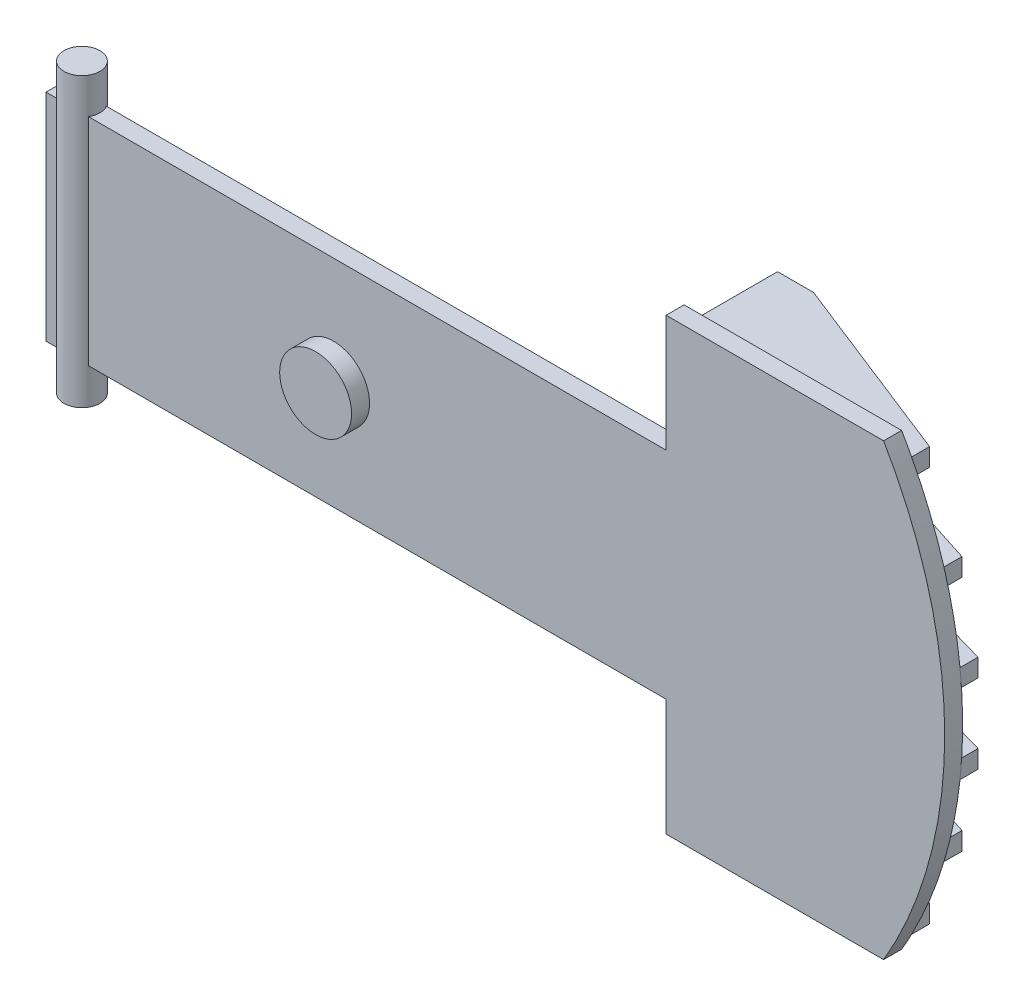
ISO-10303-21;
HEADER;
FILE_DESCRIPTION(('STEP AP214'),'2;1');
FILE_NAME('part.step','',(''),(''),'','','');
FILE_SCHEMA(('AUTOMOTIVE_DESIGN { 1 0 10303 214 1 1 1 1 }'));
ENDSEC;
DATA;
#1=APPLICATION_CONTEXT('core data for automotive mechanical design processes');
#2=APPLICATION_PROTOCOL_DEFINITION('international standard','automotive_design',2000,#1);
#3=PRODUCT_CONTEXT('',#1,'mechanical');
#4=PRODUCT('Part','Part','',(#3));
#5=PRODUCT_RELATED_PRODUCT_CATEGORY('part','',(#4));
#6=PRODUCT_DEFINITION_FORMATION('','',#4);
#7=PRODUCT_DEFINITION_CONTEXT('part definition',#1,'design');
#8=PRODUCT_DEFINITION('design','',#6,#7);
#9=PRODUCT_DEFINITION_SHAPE('','',#8);
#10=(LENGTH_UNIT() NAMED_UNIT(*) SI_UNIT(.MILLI.,.METRE.));
#11=(NAMED_UNIT(*) PLANE_ANGLE_UNIT() SI_UNIT($,.RADIAN.));
#12=(NAMED_UNIT(*) SI_UNIT($,.STERADIAN.) SOLID_ANGLE_UNIT());
#13=UNCERTAINTY_MEASURE_WITH_UNIT(LENGTH_MEASURE(1.E-05),#10,'distance_accuracy_value','');
#14=(GEOMETRIC_REPRESENTATION_CONTEXT(3) GLOBAL_UNCERTAINTY_ASSIGNED_CONTEXT((#13)) GLOBAL_UNIT_ASSIGNED_CONTEXT((#10,
#11,#12)) REPRESENTATION_CONTEXT('',''));
#15=CARTESIAN_POINT('',(0.,0.,0.));
#16=DIRECTION('',(0.,0.,1.));
#17=DIRECTION('',(1.,0.,0.));
#18=AXIS2_PLACEMENT_3D('',#15,#16,#17);
#19=CARTESIAN_POINT('',(25.3220588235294,0.,0.));
#20=DIRECTION('',(0.,0.,-1.));
#21=DIRECTION('',(-1.,0.,0.));
#22=AXIS2_PLACEMENT_3D('',#19,#20,#21);
#23=PLANE('',#22);
#24=DIRECTION('',(1.,0.,0.));
#25=VECTOR('',#24,1.);
#26=CARTESIAN_POINT('',(49.851852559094,-1.69999999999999,0.));
#27=LINE('',#26,#25);
#28=CARTESIAN_POINT('',(34.5,-1.69999999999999,0.));
#29=VERTEX_POINT('',#28);
#30=CARTESIAN_POINT('',(49.851852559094,-1.69999999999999,0.));
#31=VERTEX_POINT('',#30);
#32=EDGE_CURVE('E323',#29,#31,#27,.T.);
#33=ORIENTED_EDGE('',*,*,#32,.F.);
#34=DIRECTION('',(0.,-1.,0.));
#35=VECTOR('',#34,1.);
#36=CARTESIAN_POINT('',(34.5,-1.69999999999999,0.));
#37=LINE('',#36,#35);
#38=CARTESIAN_POINT('',(34.5,-2.69999999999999,0.));
#39=VERTEX_POINT('',#38);
#40=EDGE_CURVE('E308',#29,#39,#37,.T.);
#41=ORIENTED_EDGE('',*,*,#40,.T.);
#42=DIRECTION('',(1.,0.,0.));
#43=VECTOR('',#42,1.);
#44=CARTESIAN_POINT('',(49.851852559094,-2.69999999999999,0.));
#45=LINE('',#44,#43);
#46=CARTESIAN_POINT('',(49.851852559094,-2.70000000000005,0.));
#47=VERTEX_POINT('',#46);
#48=EDGE_CURVE('E314',#39,#47,#45,.T.);
#49=ORIENTED_EDGE('',*,*,#48,.T.);
#50=CARTESIAN_POINT('',(25.3220588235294,0.,0.));
#51=DIRECTION('',(0.,0.,1.));
#52=DIRECTION('',(-1.,0.,0.));
#53=AXIS2_PLACEMENT_3D('',#50,#51,#52);
#54=CIRCLE('',#53,24.6779411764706);
#55=CARTESIAN_POINT('',(48.9565840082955,-7.1,0.));
#56=VERTEX_POINT('',#55);
#57=EDGE_CURVE('E717',#56,#47,#54,.T.);
#58=ORIENTED_EDGE('',*,*,#57,.F.);
#59=DIRECTION('',(0.,-1.,0.));
#60=VECTOR('',#59,1.);
#61=CARTESIAN_POINT('',(48.9565840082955,-6.1,0.));
#62=LINE('',#61,#60);
#63=CARTESIAN_POINT('',(48.9565840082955,-6.1,0.));
#64=VERTEX_POINT('',#63);
#65=EDGE_CURVE('E354',#64,#56,#62,.T.);
#66=ORIENTED_EDGE('',*,*,#65,.F.);
#67=DIRECTION('',(1.,0.,0.));
#68=VECTOR('',#67,1.);
#69=CARTESIAN_POINT('',(48.9565840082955,-6.1,0.));
#70=LINE('',#69,#68);
#71=CARTESIAN_POINT('',(34.5,-6.1,0.));
#72=VERTEX_POINT('',#71);
#73=EDGE_CURVE('E346',#72,#64,#70,.T.);
#74=ORIENTED_EDGE('',*,*,#73,.F.);
#75=DIRECTION('',(0.,-1.,0.));
#76=VECTOR('',#75,1.);
#77=CARTESIAN_POINT('',(34.5,-6.,0.));
#78=LINE('',#77,#76);
#79=CARTESIAN_POINT('',(34.5,-6.,0.));
#80=VERTEX_POINT('',#79);
#81=EDGE_CURVE('E551',#80,#72,#78,.T.);
#82=ORIENTED_EDGE('',*,*,#81,.F.);
#83=DIRECTION('',(1.,0.,0.));
#84=VECTOR('',#83,1.);
#85=CARTESIAN_POINT('',(0.,-6.,0.));
#86=LINE('',#85,#84);
#87=CARTESIAN_POINT('',(2.36602540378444,-6.,0.));
#88=VERTEX_POINT('',#87);
#89=EDGE_CURVE('E546',#88,#80,#86,.T.);
#90=ORIENTED_EDGE('',*,*,#89,.F.);
#91=DIRECTION('',(0.,1.,0.));
#92=VECTOR('',#91,1.);
#93=CARTESIAN_POINT('',(2.36602540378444,-8.,0.));
#94=LINE('',#93,#92);
#95=CARTESIAN_POINT('',(2.36602540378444,6.,0.));
#96=VERTEX_POINT('',#95);
#97=EDGE_CURVE('E39',#88,#96,#94,.T.);
#98=ORIENTED_EDGE('',*,*,#97,.T.);
#99=DIRECTION('',(-1.,0.,0.));
#100=VECTOR('',#99,1.);
#101=CARTESIAN_POINT('',(0.,6.,0.));
#102=LINE('',#101,#100);
#103=CARTESIAN_POINT('',(34.5,6.,0.));
#104=VERTEX_POINT('',#103);
#105=EDGE_CURVE('E541',#104,#96,#102,.T.);
#106=ORIENTED_EDGE('',*,*,#105,.F.);
#107=DIRECTION('',(0.,-1.,0.));
#108=VECTOR('',#107,1.);
#109=CARTESIAN_POINT('',(34.5,6.,0.));
#110=LINE('',#109,#108);
#111=CARTESIAN_POINT('',(34.5,6.1,0.));
#112=VERTEX_POINT('',#111);
#113=EDGE_CURVE('E535',#112,#104,#110,.T.);
#114=ORIENTED_EDGE('',*,*,#113,.F.);
#115=DIRECTION('',(1.,0.,0.));
#116=VECTOR('',#115,1.);
#117=CARTESIAN_POINT('',(48.9565840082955,6.1,0.));
#118=LINE('',#117,#116);
#119=CARTESIAN_POINT('',(48.9565840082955,6.1,0.));
#120=VERTEX_POINT('',#119);
#121=EDGE_CURVE('E467',#112,#120,#118,.T.);
#122=ORIENTED_EDGE('',*,*,#121,.T.);
#123=DIRECTION('',(0.,1.,0.));
#124=VECTOR('',#123,1.);
#125=CARTESIAN_POINT('',(48.9565840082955,6.1,0.));
#126=LINE('',#125,#124);
#127=CARTESIAN_POINT('',(48.9565840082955,7.1,0.));
#128=VERTEX_POINT('',#127);
#129=EDGE_CURVE('E471',#120,#128,#126,.T.);
#130=ORIENTED_EDGE('',*,*,#129,.T.);
#131=CARTESIAN_POINT('',(49.851852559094,2.69999999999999,0.));
#132=VERTEX_POINT('',#131);
#133=EDGE_CURVE('E641',#132,#128,#54,.T.);
#134=ORIENTED_EDGE('',*,*,#133,.F.);
#135=DIRECTION('',(1.,0.,0.));
#136=VECTOR('',#135,1.);
#137=CARTESIAN_POINT('',(49.851852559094,2.69999999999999,0.));
#138=LINE('',#137,#136);
#139=CARTESIAN_POINT('',(34.5,2.69999999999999,0.));
#140=VERTEX_POINT('',#139);
#141=EDGE_CURVE('E412',#140,#132,#138,.T.);
#142=ORIENTED_EDGE('',*,*,#141,.F.);
#143=DIRECTION('',(0.,1.,0.));
#144=VECTOR('',#143,1.);
#145=CARTESIAN_POINT('',(34.5,1.69999999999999,0.));
#146=LINE('',#145,#144);
#147=CARTESIAN_POINT('',(34.5,1.69999999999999,0.));
#148=VERTEX_POINT('',#147);
#149=EDGE_CURVE('E434',#148,#140,#146,.T.);
#150=ORIENTED_EDGE('',*,*,#149,.F.);
#151=DIRECTION('',(1.,0.,0.));
#152=VECTOR('',#151,1.);
#153=CARTESIAN_POINT('',(49.851852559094,1.69999999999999,0.));
#154=LINE('',#153,#152);
#155=CARTESIAN_POINT('',(49.851852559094,1.69999999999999,0.));
#156=VERTEX_POINT('',#155);
#157=EDGE_CURVE('E426',#148,#156,#154,.T.);
#158=ORIENTED_EDGE('',*,*,#157,.T.);
#159=DIRECTION('',(0.,1.,0.));
#160=VECTOR('',#159,1.);
#161=CARTESIAN_POINT('',(49.851852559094,1.69999999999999,0.));
#162=LINE('',#161,#160);
#163=EDGE_CURVE('E430',#156,#132,#162,.T.);
#164=ORIENTED_EDGE('',*,*,#163,.T.);
#165=EDGE_CURVE('E563',#47,#132,#54,.T.);
#166=ORIENTED_EDGE('',*,*,#165,.F.);
#167=DIRECTION('',(0.,-1.,0.));
#168=VECTOR('',#167,1.);
#169=CARTESIAN_POINT('',(49.851852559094,-1.69999999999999,0.));
#170=LINE('',#169,#168);
#171=EDGE_CURVE('E324',#31,#47,#170,.T.);
#172=ORIENTED_EDGE('',*,*,#171,.F.);
#173=EDGE_LOOP('',(#33,#41,#49,#58,#66,#74,#82,#90,#98,#106,#114,#122,#130,#134,#142,#150,#158,
#164,#166,#172));
#174=FACE_BOUND('',#173,.T.);
#175=ADVANCED_FACE('F31',(#174),#23,.T.);
#176=CARTESIAN_POINT('',(34.5,-11.5,0.));
#177=VERTEX_POINT('',#176);
#178=CARTESIAN_POINT('',(34.5,-12.5,0.));
#179=VERTEX_POINT('',#178);
#180=EDGE_CURVE('E550',#177,#179,#78,.T.);
#181=ORIENTED_EDGE('',*,*,#180,.F.);
#182=DIRECTION('',(1.,0.,0.));
#183=VECTOR('',#182,1.);
#184=CARTESIAN_POINT('',(47.1566822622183,-11.5,0.));
#185=LINE('',#184,#183);
#186=CARTESIAN_POINT('',(47.1566822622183,-11.5,0.));
#187=VERTEX_POINT('',#186);
#188=EDGE_CURVE('E358',#177,#187,#185,.T.);
#189=ORIENTED_EDGE('',*,*,#188,.T.);
#190=CARTESIAN_POINT('',(46.6,-12.5,0.));
#191=VERTEX_POINT('',#190);
#192=EDGE_CURVE('E558',#191,#187,#54,.T.);
#193=ORIENTED_EDGE('',*,*,#192,.F.);
#194=DIRECTION('',(1.,0.,0.));
#195=VECTOR('',#194,1.);
#196=CARTESIAN_POINT('',(34.5,-12.5,0.));
#197=LINE('',#196,#195);
#198=EDGE_CURVE('E554',#179,#191,#197,.T.);
#199=ORIENTED_EDGE('',*,*,#198,.F.);
#200=EDGE_LOOP('',(#181,#189,#193,#199));
#201=FACE_BOUND('',#200,.T.);
#202=ADVANCED_FACE('F666',(#201),#23,.T.);
#203=DIRECTION('',(1.,0.,0.));
#204=VECTOR('',#203,1.);
#205=CARTESIAN_POINT('',(48.9565840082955,-7.1,0.));
#206=LINE('',#205,#204);
#207=CARTESIAN_POINT('',(34.5,-7.1,0.));
#208=VERTEX_POINT('',#207);
#209=EDGE_CURVE('E54',#208,#56,#206,.T.);
#210=ORIENTED_EDGE('',*,*,#209,.T.);
#211=EDGE_CURVE('E562',#187,#56,#54,.T.);
#212=ORIENTED_EDGE('',*,*,#211,.F.);
#213=DIRECTION('',(0.,-1.,0.));
#214=VECTOR('',#213,1.);
#215=CARTESIAN_POINT('',(47.1566822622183,-10.5,0.));
#216=LINE('',#215,#214);
#217=CARTESIAN_POINT('',(47.1566822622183,-10.5,0.));
#218=VERTEX_POINT('',#217);
#219=EDGE_CURVE('E390',#218,#187,#216,.T.);
#220=ORIENTED_EDGE('',*,*,#219,.F.);
#221=DIRECTION('',(1.,0.,0.));
#222=VECTOR('',#221,1.);
#223=CARTESIAN_POINT('',(47.1566822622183,-10.5,0.));
#224=LINE('',#223,#222);
#225=CARTESIAN_POINT('',(34.5,-10.5,0.));
#226=VERTEX_POINT('',#225);
#227=EDGE_CURVE('E377',#226,#218,#224,.T.);
#228=ORIENTED_EDGE('',*,*,#227,.F.);
#229=EDGE_CURVE('E555',#208,#226,#78,.T.);
#230=ORIENTED_EDGE('',*,*,#229,.F.);
#231=EDGE_LOOP('',(#210,#212,#220,#228,#230));
#232=FACE_BOUND('',#231,.T.);
#233=ADVANCED_FACE('F672',(#232),#23,.T.);
#234=CARTESIAN_POINT('',(47.1566822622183,11.5,0.));
#235=VERTEX_POINT('',#234);
#236=CARTESIAN_POINT('',(46.6,12.5,0.));
#237=VERTEX_POINT('',#236);
#238=EDGE_CURVE('E557',#235,#237,#54,.T.);
#239=ORIENTED_EDGE('',*,*,#238,.F.);
#240=DIRECTION('',(1.,0.,0.));
#241=VECTOR('',#240,1.);
#242=CARTESIAN_POINT('',(47.1566822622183,11.5,0.));
#243=LINE('',#242,#241);
#244=CARTESIAN_POINT('',(34.5,11.5,0.));
#245=VERTEX_POINT('',#244);
#246=EDGE_CURVE('E474',#245,#235,#243,.T.);
#247=ORIENTED_EDGE('',*,*,#246,.F.);
#248=CARTESIAN_POINT('',(34.5,12.5,0.));
#249=VERTEX_POINT('',#248);
#250=EDGE_CURVE('E536',#249,#245,#110,.T.);
#251=ORIENTED_EDGE('',*,*,#250,.F.);
#252=DIRECTION('',(-1.,0.,0.));
#253=VECTOR('',#252,1.);
#254=CARTESIAN_POINT('',(34.5,12.5,0.));
#255=LINE('',#254,#253);
#256=EDGE_CURVE('E561',#237,#249,#255,.T.);
#257=ORIENTED_EDGE('',*,*,#256,.F.);
#258=EDGE_LOOP('',(#239,#247,#251,#257));
#259=FACE_BOUND('',#258,.T.);
#260=ADVANCED_FACE('F693',(#259),#23,.T.);
#261=CARTESIAN_POINT('',(25.3220588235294,0.,1.));
#262=DIRECTION('',(0.,0.,-1.));
#263=DIRECTION('',(-1.,0.,0.));
#264=AXIS2_PLACEMENT_3D('',#261,#262,#263);
#265=PLANE('',#264);
#266=CARTESIAN_POINT('',(16.,0.,1.));
#267=DIRECTION('',(0.,0.,-1.));
#268=DIRECTION('',(-1.,0.,0.));
#269=AXIS2_PLACEMENT_3D('',#266,#267,#268);
#270=CIRCLE('',#269,2.);
#271=CARTESIAN_POINT('',(14.,0.,1.));
#272=VERTEX_POINT('',#271);
#273=EDGE_CURVE('E610',#272,#272,#270,.F.);
#274=ORIENTED_EDGE('',*,*,#273,.F.);
#275=EDGE_LOOP('',(#274));
#276=FACE_BOUND('',#275,.T.);
#277=DIRECTION('',(0.,1.,0.));
#278=VECTOR('',#277,1.);
#279=CARTESIAN_POINT('',(2.36602540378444,-8.,1.));
#280=LINE('',#279,#278);
#281=CARTESIAN_POINT('',(2.36602540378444,-6.,1.));
#282=VERTEX_POINT('',#281);
#283=CARTESIAN_POINT('',(2.36602540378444,6.,1.));
#284=VERTEX_POINT('',#283);
#285=EDGE_CURVE('E527',#282,#284,#280,.T.);
#286=ORIENTED_EDGE('',*,*,#285,.F.);
#287=DIRECTION('',(1.,0.,0.));
#288=VECTOR('',#287,1.);
#289=CARTESIAN_POINT('',(0.,-6.,1.));
#290=LINE('',#289,#288);
#291=CARTESIAN_POINT('',(34.5,-6.,1.));
#292=VERTEX_POINT('',#291);
#293=EDGE_CURVE('E574',#282,#292,#290,.T.);
#294=ORIENTED_EDGE('',*,*,#293,.T.);
#295=DIRECTION('',(0.,-1.,0.));
#296=VECTOR('',#295,1.);
#297=CARTESIAN_POINT('',(34.5,-6.,1.));
#298=LINE('',#297,#296);
#299=CARTESIAN_POINT('',(34.5,-12.5,1.));
#300=VERTEX_POINT('',#299);
#301=EDGE_CURVE('E578',#292,#300,#298,.T.);
#302=ORIENTED_EDGE('',*,*,#301,.T.);
#303=DIRECTION('',(1.,0.,0.));
#304=VECTOR('',#303,1.);
#305=CARTESIAN_POINT('',(34.5,-12.5,1.));
#306=LINE('',#305,#304);
#307=CARTESIAN_POINT('',(46.6,-12.5,1.));
#308=VERTEX_POINT('',#307);
#309=EDGE_CURVE('E580',#300,#308,#306,.T.);
#310=ORIENTED_EDGE('',*,*,#309,.T.);
#311=CARTESIAN_POINT('',(25.3220588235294,0.,1.));
#312=DIRECTION('',(0.,0.,1.));
#313=DIRECTION('',(-1.,0.,0.));
#314=AXIS2_PLACEMENT_3D('',#311,#312,#313);
#315=CIRCLE('',#314,24.6779411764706);
#316=CARTESIAN_POINT('',(46.6,12.5,1.));
#317=VERTEX_POINT('',#316);
#318=EDGE_CURVE('E582',#308,#317,#315,.T.);
#319=ORIENTED_EDGE('',*,*,#318,.T.);
#320=DIRECTION('',(-1.,0.,0.));
#321=VECTOR('',#320,1.);
#322=CARTESIAN_POINT('',(34.5,12.5,1.));
#323=LINE('',#322,#321);
#324=CARTESIAN_POINT('',(34.5,12.5,1.));
#325=VERTEX_POINT('',#324);
#326=EDGE_CURVE('E584',#317,#325,#323,.T.);
#327=ORIENTED_EDGE('',*,*,#326,.T.);
#328=DIRECTION('',(0.,-1.,0.));
#329=VECTOR('',#328,1.);
#330=CARTESIAN_POINT('',(34.5,6.,1.));
#331=LINE('',#330,#329);
#332=CARTESIAN_POINT('',(34.5,6.,1.));
#333=VERTEX_POINT('',#332);
#334=EDGE_CURVE('E565',#325,#333,#331,.T.);
#335=ORIENTED_EDGE('',*,*,#334,.T.);
#336=DIRECTION('',(-1.,0.,0.));
#337=VECTOR('',#336,1.);
#338=CARTESIAN_POINT('',(0.,6.,1.));
#339=LINE('',#338,#337);
#340=EDGE_CURVE('E569',#333,#284,#339,.T.);
#341=ORIENTED_EDGE('',*,*,#340,.T.);
#342=EDGE_LOOP('',(#286,#294,#302,#310,#319,#327,#335,#341));
#343=FACE_BOUND('',#342,.T.);
#344=ADVANCED_FACE('F701',(#276,#343),#265,.F.);
#345=CARTESIAN_POINT('',(0.,6.,1.));
#346=DIRECTION('',(0.,-1.,0.));
#347=DIRECTION('',(0.,0.,-1.));
#348=AXIS2_PLACEMENT_3D('',#345,#346,#347);
#349=PLANE('',#348);
#350=CARTESIAN_POINT('',(1.5,6.,0.5));
#351=DIRECTION('',(0.,-1.,0.));
#352=DIRECTION('',(0.,0.,-1.));
#353=AXIS2_PLACEMENT_3D('',#350,#351,#352);
#354=CIRCLE('',#353,1.);
#355=EDGE_CURVE('E524',#284,#96,#354,.F.);
#356=ORIENTED_EDGE('',*,*,#355,.F.);
#357=ORIENTED_EDGE('',*,*,#340,.F.);
#358=DIRECTION('',(0.,0.,-1.));
#359=VECTOR('',#358,1.);
#360=CARTESIAN_POINT('',(34.5,6.,1.));
#361=LINE('',#360,#359);
#362=EDGE_CURVE('E607',#333,#104,#361,.T.);
#363=ORIENTED_EDGE('',*,*,#362,.T.);
#364=ORIENTED_EDGE('',*,*,#105,.T.);
#365=EDGE_LOOP('',(#356,#357,#363,#364));
#366=FACE_BOUND('',#365,.T.);
#367=ADVANCED_FACE('F621',(#366),#349,.F.);
#368=CARTESIAN_POINT('',(0.,-6.,1.));
#369=DIRECTION('',(0.,1.,0.));
#370=DIRECTION('',(0.,0.,1.));
#371=AXIS2_PLACEMENT_3D('',#368,#369,#370);
#372=PLANE('',#371);
#373=CARTESIAN_POINT('',(1.5,-6.,0.5));
#374=DIRECTION('',(0.,1.,0.));
#375=DIRECTION('',(0.,0.,1.));
#376=AXIS2_PLACEMENT_3D('',#373,#374,#375);
#377=CIRCLE('',#376,1.);
#378=EDGE_CURVE('E522',#88,#282,#377,.F.);
#379=ORIENTED_EDGE('',*,*,#378,.F.);
#380=ORIENTED_EDGE('',*,*,#89,.T.);
#381=DIRECTION('',(0.,0.,-1.));
#382=VECTOR('',#381,1.);
#383=CARTESIAN_POINT('',(34.5,-6.,1.));
#384=LINE('',#383,#382);
#385=EDGE_CURVE('E598',#292,#80,#384,.T.);
#386=ORIENTED_EDGE('',*,*,#385,.F.);
#387=ORIENTED_EDGE('',*,*,#293,.F.);
#388=EDGE_LOOP('',(#379,#380,#386,#387));
#389=FACE_BOUND('',#388,.T.);
#390=ADVANCED_FACE('F687',(#389),#372,.F.);
#391=DIRECTION('',(1.,0.,0.));
#392=VECTOR('',#391,1.);
#393=CARTESIAN_POINT('',(48.9565840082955,7.1,0.));
#394=LINE('',#393,#392);
#395=CARTESIAN_POINT('',(34.5,7.1,0.));
#396=VERTEX_POINT('',#395);
#397=EDGE_CURVE('E452',#396,#128,#394,.T.);
#398=ORIENTED_EDGE('',*,*,#397,.F.);
#399=CARTESIAN_POINT('',(34.5,10.5,0.));
#400=VERTEX_POINT('',#399);
#401=EDGE_CURVE('E540',#400,#396,#110,.T.);
#402=ORIENTED_EDGE('',*,*,#401,.F.);
#403=DIRECTION('',(1.,0.,0.));
#404=VECTOR('',#403,1.);
#405=CARTESIAN_POINT('',(47.1566822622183,10.5,0.));
#406=LINE('',#405,#404);
#407=CARTESIAN_POINT('',(47.1566822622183,10.5,0.));
#408=VERTEX_POINT('',#407);
#409=EDGE_CURVE('E493',#400,#408,#406,.T.);
#410=ORIENTED_EDGE('',*,*,#409,.T.);
#411=DIRECTION('',(0.,1.,0.));
#412=VECTOR('',#411,1.);
#413=CARTESIAN_POINT('',(47.1566822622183,10.5,0.));
#414=LINE('',#413,#412);
#415=EDGE_CURVE('E507',#408,#235,#414,.T.);
#416=ORIENTED_EDGE('',*,*,#415,.T.);
#417=EDGE_CURVE('E635',#128,#235,#54,.T.);
#418=ORIENTED_EDGE('',*,*,#417,.F.);
#419=EDGE_LOOP('',(#398,#402,#410,#416,#418));
#420=FACE_BOUND('',#419,.T.);
#421=ADVANCED_FACE('F633',(#420),#23,.T.);
#422=CARTESIAN_POINT('',(34.5,6.,1.));
#423=DIRECTION('',(1.,0.,0.));
#424=DIRECTION('',(0.,0.,-1.));
#425=AXIS2_PLACEMENT_3D('',#422,#423,#424);
#426=PLANE('',#425);
#427=ORIENTED_EDGE('',*,*,#250,.T.);
#428=DIRECTION('',(0.,0.,1.));
#429=VECTOR('',#428,1.);
#430=CARTESIAN_POINT('',(34.5,11.5,0.));
#431=LINE('',#430,#429);
#432=CARTESIAN_POINT('',(34.5,11.5,-5.2));
#433=VERTEX_POINT('',#432);
#434=EDGE_CURVE('E491',#433,#245,#431,.T.);
#435=ORIENTED_EDGE('',*,*,#434,.F.);
#436=DIRECTION('',(0.,1.,0.));
#437=VECTOR('',#436,1.);
#438=CARTESIAN_POINT('',(34.5,10.5,-5.2));
#439=LINE('',#438,#437);
#440=CARTESIAN_POINT('',(34.5,10.5,-5.2));
#441=VERTEX_POINT('',#440);
#442=EDGE_CURVE('E508',#441,#433,#439,.T.);
#443=ORIENTED_EDGE('',*,*,#442,.F.);
#444=DIRECTION('',(0.,0.,1.));
#445=VECTOR('',#444,1.);
#446=CARTESIAN_POINT('',(34.5,10.5,0.));
#447=LINE('',#446,#445);
#448=EDGE_CURVE('E505',#441,#400,#447,.T.);
#449=ORIENTED_EDGE('',*,*,#448,.T.);
#450=ORIENTED_EDGE('',*,*,#401,.T.);
#451=DIRECTION('',(0.,0.,1.));
#452=VECTOR('',#451,1.);
#453=CARTESIAN_POINT('',(34.5,7.1,0.));
#454=LINE('',#453,#452);
#455=CARTESIAN_POINT('',(34.5,7.1,-5.));
#456=VERTEX_POINT('',#455);
#457=EDGE_CURVE('E450',#456,#396,#454,.T.);
#458=ORIENTED_EDGE('',*,*,#457,.F.);
#459=DIRECTION('',(0.,1.,0.));
#460=VECTOR('',#459,1.);
#461=CARTESIAN_POINT('',(34.5,6.1,-5.));
#462=LINE('',#461,#460);
#463=CARTESIAN_POINT('',(34.5,6.1,-5.));
#464=VERTEX_POINT('',#463);
#465=EDGE_CURVE('E475',#464,#456,#462,.T.);
#466=ORIENTED_EDGE('',*,*,#465,.F.);
#467=DIRECTION('',(0.,0.,1.));
#468=VECTOR('',#467,1.);
#469=CARTESIAN_POINT('',(34.5,6.1,0.));
#470=LINE('',#469,#468);
#471=EDGE_CURVE('E464',#464,#112,#470,.T.);
#472=ORIENTED_EDGE('',*,*,#471,.T.);
#473=ORIENTED_EDGE('',*,*,#113,.T.);
#474=ORIENTED_EDGE('',*,*,#362,.F.);
#475=ORIENTED_EDGE('',*,*,#334,.F.);
#476=DIRECTION('',(0.,0.,-1.));
#477=VECTOR('',#476,1.);
#478=CARTESIAN_POINT('',(34.5,12.5,1.));
#479=LINE('',#478,#477);
#480=EDGE_CURVE('E586',#325,#249,#479,.T.);
#481=ORIENTED_EDGE('',*,*,#480,.T.);
#482=EDGE_LOOP('',(#427,#435,#443,#449,#450,#458,#466,#472,#473,#474,#475,#481));
#483=FACE_BOUND('',#482,.T.);
#484=ADVANCED_FACE('F33',(#483),#426,.F.);
#485=CARTESIAN_POINT('',(34.5,-6.,1.));
#486=DIRECTION('',(1.,0.,0.));
#487=DIRECTION('',(0.,0.,-1.));
#488=AXIS2_PLACEMENT_3D('',#485,#486,#487);
#489=PLANE('',#488);
#490=ORIENTED_EDGE('',*,*,#81,.T.);
#491=DIRECTION('',(0.,0.,1.));
#492=VECTOR('',#491,1.);
#493=CARTESIAN_POINT('',(34.5,-6.1,0.));
#494=LINE('',#493,#492);
#495=CARTESIAN_POINT('',(34.5,-6.1,-5.));
#496=VERTEX_POINT('',#495);
#497=EDGE_CURVE('E348',#496,#72,#494,.T.);
#498=ORIENTED_EDGE('',*,*,#497,.F.);
#499=DIRECTION('',(0.,-1.,0.));
#500=VECTOR('',#499,1.);
#501=CARTESIAN_POINT('',(34.5,-6.1,-5.));
#502=LINE('',#501,#500);
#503=CARTESIAN_POINT('',(34.5,-7.1,-5.));
#504=VERTEX_POINT('',#503);
#505=EDGE_CURVE('E362',#496,#504,#502,.T.);
#506=ORIENTED_EDGE('',*,*,#505,.T.);
#507=DIRECTION('',(0.,0.,1.));
#508=VECTOR('',#507,1.);
#509=CARTESIAN_POINT('',(34.5,-7.1,0.));
#510=LINE('',#509,#508);
#511=EDGE_CURVE('E337',#504,#208,#510,.T.);
#512=ORIENTED_EDGE('',*,*,#511,.T.);
#513=ORIENTED_EDGE('',*,*,#229,.T.);
#514=DIRECTION('',(0.,0.,1.));
#515=VECTOR('',#514,1.);
#516=CARTESIAN_POINT('',(34.5,-10.5,0.));
#517=LINE('',#516,#515);
#518=CARTESIAN_POINT('',(34.5,-10.5,-5.2));
#519=VERTEX_POINT('',#518);
#520=EDGE_CURVE('E380',#519,#226,#517,.T.);
#521=ORIENTED_EDGE('',*,*,#520,.F.);
#522=DIRECTION('',(0.,-1.,0.));
#523=VECTOR('',#522,1.);
#524=CARTESIAN_POINT('',(34.5,-10.5,-5.2));
#525=LINE('',#524,#523);
#526=CARTESIAN_POINT('',(34.5,-11.5,-5.2));
#527=VERTEX_POINT('',#526);
#528=EDGE_CURVE('E389',#519,#527,#525,.T.);
#529=ORIENTED_EDGE('',*,*,#528,.T.);
#530=DIRECTION('',(0.,0.,1.));
#531=VECTOR('',#530,1.);
#532=CARTESIAN_POINT('',(34.5,-11.5,0.));
#533=LINE('',#532,#531);
#534=EDGE_CURVE('E368',#527,#177,#533,.T.);
#535=ORIENTED_EDGE('',*,*,#534,.T.);
#536=ORIENTED_EDGE('',*,*,#180,.T.);
#537=DIRECTION('',(0.,0.,-1.));
#538=VECTOR('',#537,1.);
#539=CARTESIAN_POINT('',(34.5,-12.5,1.));
#540=LINE('',#539,#538);
#541=EDGE_CURVE('E595',#300,#179,#540,.T.);
#542=ORIENTED_EDGE('',*,*,#541,.F.);
#543=ORIENTED_EDGE('',*,*,#301,.F.);
#544=ORIENTED_EDGE('',*,*,#385,.T.);
#545=EDGE_LOOP('',(#490,#498,#506,#512,#513,#521,#529,#535,#536,#542,#543,#544));
#546=FACE_BOUND('',#545,.T.);
#547=ADVANCED_FACE('F698',(#546),#489,.F.);
#548=CARTESIAN_POINT('',(34.5,-12.5,1.));
#549=DIRECTION('',(0.,1.,0.));
#550=DIRECTION('',(0.,0.,1.));
#551=AXIS2_PLACEMENT_3D('',#548,#549,#550);
#552=PLANE('',#551);
#553=ORIENTED_EDGE('',*,*,#198,.T.);
#554=DIRECTION('',(0.,0.,-1.));
#555=VECTOR('',#554,1.);
#556=CARTESIAN_POINT('',(46.6,-12.5,1.));
#557=LINE('',#556,#555);
#558=EDGE_CURVE('E592',#308,#191,#557,.T.);
#559=ORIENTED_EDGE('',*,*,#558,.F.);
#560=ORIENTED_EDGE('',*,*,#309,.F.);
#561=ORIENTED_EDGE('',*,*,#541,.T.);
#562=EDGE_LOOP('',(#553,#559,#560,#561));
#563=FACE_BOUND('',#562,.T.);
#564=ADVANCED_FACE('F743',(#563),#552,.F.);
#565=CARTESIAN_POINT('',(25.3220588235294,0.,1.));
#566=DIRECTION('',(0.,0.,-1.));
#567=DIRECTION('',(-1.,0.,0.));
#568=AXIS2_PLACEMENT_3D('',#565,#566,#567);
#569=CYLINDRICAL_SURFACE('',#568,24.6779411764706);
#570=ORIENTED_EDGE('',*,*,#192,.T.);
#571=ORIENTED_EDGE('',*,*,#211,.T.);
#572=ORIENTED_EDGE('',*,*,#57,.T.);
#573=ORIENTED_EDGE('',*,*,#165,.T.);
#574=ORIENTED_EDGE('',*,*,#133,.T.);
#575=ORIENTED_EDGE('',*,*,#417,.T.);
#576=ORIENTED_EDGE('',*,*,#238,.T.);
#577=DIRECTION('',(0.,0.,-1.));
#578=VECTOR('',#577,1.);
#579=CARTESIAN_POINT('',(46.6,12.5,1.));
#580=LINE('',#579,#578);
#581=EDGE_CURVE('E589',#317,#237,#580,.T.);
#582=ORIENTED_EDGE('',*,*,#581,.F.);
#583=ORIENTED_EDGE('',*,*,#318,.F.);
#584=ORIENTED_EDGE('',*,*,#558,.T.);
#585=EDGE_LOOP('',(#570,#571,#572,#573,#574,#575,#576,#582,#583,#584));
#586=FACE_BOUND('',#585,.T.);
#587=ADVANCED_FACE('F721',(#586),#569,.T.);
#588=CARTESIAN_POINT('',(34.5,12.5,1.));
#589=DIRECTION('',(0.,-1.,0.));
#590=DIRECTION('',(0.,0.,-1.));
#591=AXIS2_PLACEMENT_3D('',#588,#589,#590);
#592=PLANE('',#591);
#593=ORIENTED_EDGE('',*,*,#256,.T.);
#594=ORIENTED_EDGE('',*,*,#480,.F.);
#595=ORIENTED_EDGE('',*,*,#326,.F.);
#596=ORIENTED_EDGE('',*,*,#581,.T.);
#597=EDGE_LOOP('',(#593,#594,#595,#596));
#598=FACE_BOUND('',#597,.T.);
#599=ADVANCED_FACE('F1030',(#598),#592,.F.);
#600=CARTESIAN_POINT('',(16.,0.,2.));
#601=DIRECTION('',(0.,0.,-1.));
#602=DIRECTION('',(-1.,0.,0.));
#603=AXIS2_PLACEMENT_3D('',#600,#601,#602);
#604=CYLINDRICAL_SURFACE('',#603,2.);
#605=CARTESIAN_POINT('',(16.,0.,2.));
#606=DIRECTION('',(0.,0.,1.));
#607=DIRECTION('',(1.,0.,0.));
#608=AXIS2_PLACEMENT_3D('',#605,#606,#607);
#609=CIRCLE('',#608,2.);
#610=CARTESIAN_POINT('',(18.,0.,2.));
#611=VERTEX_POINT('',#610);
#612=EDGE_CURVE('E532',#611,#611,#609,.T.);
#613=ORIENTED_EDGE('',*,*,#612,.F.);
#614=EDGE_LOOP('',(#613));
#615=FACE_BOUND('',#614,.T.);
#616=ORIENTED_EDGE('',*,*,#273,.T.);
#617=EDGE_LOOP('',(#616));
#618=FACE_BOUND('',#617,.T.);
#619=ADVANCED_FACE('F1244',(#615,#618),#604,.T.);
#620=CARTESIAN_POINT('',(16.,0.,2.));
#621=DIRECTION('',(0.,0.,1.));
#622=DIRECTION('',(1.,0.,0.));
#623=AXIS2_PLACEMENT_3D('',#620,#621,#622);
#624=PLANE('',#623);
#625=ORIENTED_EDGE('',*,*,#612,.T.);
#626=EDGE_LOOP('',(#625));
#627=FACE_BOUND('',#626,.T.);
#628=ADVANCED_FACE('F758',(#627),#624,.T.);
#629=CARTESIAN_POINT('',(1.5,-8.,0.5));
#630=DIRECTION('',(0.,1.,0.));
#631=DIRECTION('',(0.,0.,1.));
#632=AXIS2_PLACEMENT_3D('',#629,#630,#631);
#633=CYLINDRICAL_SURFACE('',#632,1.);
#634=ORIENTED_EDGE('',*,*,#378,.T.);
#635=ORIENTED_EDGE('',*,*,#285,.T.);
#636=ORIENTED_EDGE('',*,*,#355,.T.);
#637=ORIENTED_EDGE('',*,*,#97,.F.);
#638=EDGE_LOOP('',(#634,#635,#636,#637));
#639=FACE_BOUND('',#638,.T.);
#640=CARTESIAN_POINT('',(1.5,-8.,0.5));
#641=DIRECTION('',(0.,-1.,0.));
#642=DIRECTION('',(0.,0.,-1.));
#643=AXIS2_PLACEMENT_3D('',#640,#641,#642);
#644=CIRCLE('',#643,1.);
#645=CARTESIAN_POINT('',(1.5,-8.,-0.5));
#646=VERTEX_POINT('',#645);
#647=EDGE_CURVE('E519',#646,#646,#644,.T.);
#648=ORIENTED_EDGE('',*,*,#647,.F.);
#649=EDGE_LOOP('',(#648));
#650=FACE_BOUND('',#649,.T.);
#651=CARTESIAN_POINT('',(1.5,8.,0.5));
#652=DIRECTION('',(0.,-1.,0.));
#653=DIRECTION('',(0.,0.,-1.));
#654=AXIS2_PLACEMENT_3D('',#651,#652,#653);
#655=CIRCLE('',#654,1.);
#656=CARTESIAN_POINT('',(1.5,8.,-0.5));
#657=VERTEX_POINT('',#656);
#658=EDGE_CURVE('E510',#657,#657,#655,.T.);
#659=ORIENTED_EDGE('',*,*,#658,.T.);
#660=EDGE_LOOP('',(#659));
#661=FACE_BOUND('',#660,.T.);
#662=CARTESIAN_POINT('',(0.633974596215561,6.,0.));
#663=VERTEX_POINT('',#662);
#664=CARTESIAN_POINT('',(0.633974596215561,6.,1.));
#665=VERTEX_POINT('',#664);
#666=EDGE_CURVE('E528',#663,#665,#354,.F.);
#667=ORIENTED_EDGE('',*,*,#666,.T.);
#668=DIRECTION('',(0.,1.,0.));
#669=VECTOR('',#668,1.);
#670=CARTESIAN_POINT('',(0.633974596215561,-8.,1.));
#671=LINE('',#670,#669);
#672=CARTESIAN_POINT('',(0.633974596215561,-6.,1.));
#673=VERTEX_POINT('',#672);
#674=EDGE_CURVE('E530',#665,#673,#671,.F.);
#675=ORIENTED_EDGE('',*,*,#674,.T.);
#676=CARTESIAN_POINT('',(0.633974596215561,-6.,0.));
#677=VERTEX_POINT('',#676);
#678=EDGE_CURVE('E525',#673,#677,#377,.F.);
#679=ORIENTED_EDGE('',*,*,#678,.T.);
#680=DIRECTION('',(0.,1.,0.));
#681=VECTOR('',#680,1.);
#682=CARTESIAN_POINT('',(0.633974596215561,-8.,0.));
#683=LINE('',#682,#681);
#684=EDGE_CURVE('E11',#663,#677,#683,.F.);
#685=ORIENTED_EDGE('',*,*,#684,.F.);
#686=EDGE_LOOP('',(#667,#675,#679,#685));
#687=FACE_BOUND('',#686,.T.);
#688=ADVANCED_FACE('F754',(#639,#650,#661,#687),#633,.T.);
#689=CARTESIAN_POINT('',(1.5,-8.,0.5));
#690=DIRECTION('',(0.,-1.,0.));
#691=DIRECTION('',(0.,0.,-1.));
#692=AXIS2_PLACEMENT_3D('',#689,#690,#691);
#693=PLANE('',#692);
#694=ORIENTED_EDGE('',*,*,#647,.T.);
#695=EDGE_LOOP('',(#694));
#696=FACE_BOUND('',#695,.T.);
#697=ADVANCED_FACE('F757',(#696),#693,.T.);
#698=CARTESIAN_POINT('',(1.5,8.,0.5));
#699=DIRECTION('',(0.,-1.,0.));
#700=DIRECTION('',(0.,0.,-1.));
#701=AXIS2_PLACEMENT_3D('',#698,#699,#700);
#702=PLANE('',#701);
#703=ORIENTED_EDGE('',*,*,#658,.F.);
#704=EDGE_LOOP('',(#703));
#705=FACE_BOUND('',#704,.T.);
#706=ADVANCED_FACE('F688',(#705),#702,.F.);
#707=CARTESIAN_POINT('',(0.,-6.,1.));
#708=DIRECTION('',(1.,0.,0.));
#709=DIRECTION('',(0.,0.,-1.));
#710=AXIS2_PLACEMENT_3D('',#707,#708,#709);
#711=PLANE('',#710);
#712=DIRECTION('',(0.,-1.,0.));
#713=VECTOR('',#712,1.);
#714=CARTESIAN_POINT('',(0.,-6.,0.));
#715=LINE('',#714,#713);
#716=CARTESIAN_POINT('',(0.,6.,0.));
#717=VERTEX_POINT('',#716);
#718=CARTESIAN_POINT('',(0.,-6.,0.));
#719=VERTEX_POINT('',#718);
#720=EDGE_CURVE('E544',#717,#719,#715,.T.);
#721=ORIENTED_EDGE('',*,*,#720,.T.);
#722=DIRECTION('',(0.,0.,-1.));
#723=VECTOR('',#722,1.);
#724=CARTESIAN_POINT('',(0.,-6.,1.));
#725=LINE('',#724,#723);
#726=CARTESIAN_POINT('',(0.,-6.,1.));
#727=VERTEX_POINT('',#726);
#728=EDGE_CURVE('E601',#727,#719,#725,.T.);
#729=ORIENTED_EDGE('',*,*,#728,.F.);
#730=DIRECTION('',(0.,-1.,0.));
#731=VECTOR('',#730,1.);
#732=CARTESIAN_POINT('',(0.,-6.,1.));
#733=LINE('',#732,#731);
#734=CARTESIAN_POINT('',(0.,6.,1.));
#735=VERTEX_POINT('',#734);
#736=EDGE_CURVE('E572',#735,#727,#733,.T.);
#737=ORIENTED_EDGE('',*,*,#736,.F.);
#738=DIRECTION('',(0.,0.,-1.));
#739=VECTOR('',#738,1.);
#740=CARTESIAN_POINT('',(0.,6.,1.));
#741=LINE('',#740,#739);
#742=EDGE_CURVE('E604',#735,#717,#741,.T.);
#743=ORIENTED_EDGE('',*,*,#742,.T.);
#744=EDGE_LOOP('',(#721,#729,#737,#743));
#745=FACE_BOUND('',#744,.T.);
#746=ADVANCED_FACE('F678',(#745),#711,.F.);
#747=EDGE_CURVE('E539',#663,#717,#102,.T.);
#748=ORIENTED_EDGE('',*,*,#747,.F.);
#749=ORIENTED_EDGE('',*,*,#684,.T.);
#750=EDGE_CURVE('E547',#719,#677,#86,.T.);
#751=ORIENTED_EDGE('',*,*,#750,.F.);
#752=ORIENTED_EDGE('',*,*,#720,.F.);
#753=EDGE_LOOP('',(#748,#749,#751,#752));
#754=FACE_BOUND('',#753,.T.);
#755=ADVANCED_FACE('F668',(#754),#23,.T.);
#756=ORIENTED_EDGE('',*,*,#678,.F.);
#757=EDGE_CURVE('E575',#727,#673,#290,.T.);
#758=ORIENTED_EDGE('',*,*,#757,.F.);
#759=ORIENTED_EDGE('',*,*,#728,.T.);
#760=ORIENTED_EDGE('',*,*,#750,.T.);
#761=EDGE_LOOP('',(#756,#758,#759,#760));
#762=FACE_BOUND('',#761,.T.);
#763=ADVANCED_FACE('F677',(#762),#372,.F.);
#764=ORIENTED_EDGE('',*,*,#666,.F.);
#765=ORIENTED_EDGE('',*,*,#747,.T.);
#766=ORIENTED_EDGE('',*,*,#742,.F.);
#767=EDGE_CURVE('E568',#665,#735,#339,.T.);
#768=ORIENTED_EDGE('',*,*,#767,.F.);
#769=EDGE_LOOP('',(#764,#765,#766,#768));
#770=FACE_BOUND('',#769,.T.);
#771=ADVANCED_FACE('F684',(#770),#349,.F.);
#772=ORIENTED_EDGE('',*,*,#674,.F.);
#773=ORIENTED_EDGE('',*,*,#767,.T.);
#774=ORIENTED_EDGE('',*,*,#736,.T.);
#775=ORIENTED_EDGE('',*,*,#757,.T.);
#776=EDGE_LOOP('',(#772,#773,#774,#775));
#777=FACE_BOUND('',#776,.T.);
#778=ADVANCED_FACE('F708',(#777),#265,.F.);
#779=CARTESIAN_POINT('',(34.5,10.5,-5.2));
#780=DIRECTION('',(0.,0.,-1.));
#781=DIRECTION('',(-1.,0.,0.));
#782=AXIS2_PLACEMENT_3D('',#779,#780,#781);
#783=PLANE('',#782);
#784=DIRECTION('',(-1.,0.,0.));
#785=VECTOR('',#784,1.);
#786=CARTESIAN_POINT('',(34.5,11.5,-5.2));
#787=LINE('',#786,#785);
#788=CARTESIAN_POINT('',(36.5,11.5,-5.2));
#789=VERTEX_POINT('',#788);
#790=EDGE_CURVE('E488',#789,#433,#787,.T.);
#791=ORIENTED_EDGE('',*,*,#790,.F.);
#792=DIRECTION('',(0.,1.,0.));
#793=VECTOR('',#792,1.);
#794=CARTESIAN_POINT('',(36.5,10.5,-5.2));
#795=LINE('',#794,#793);
#796=CARTESIAN_POINT('',(36.5,10.5,-5.2));
#797=VERTEX_POINT('',#796);
#798=EDGE_CURVE('E511',#797,#789,#795,.T.);
#799=ORIENTED_EDGE('',*,*,#798,.F.);
#800=DIRECTION('',(-1.,0.,0.));
#801=VECTOR('',#800,1.);
#802=CARTESIAN_POINT('',(34.5,10.5,-5.2));
#803=LINE('',#802,#801);
#804=EDGE_CURVE('E502',#797,#441,#803,.T.);
#805=ORIENTED_EDGE('',*,*,#804,.T.);
#806=ORIENTED_EDGE('',*,*,#442,.T.);
#807=EDGE_LOOP('',(#791,#799,#805,#806));
#808=FACE_BOUND('',#807,.T.);
#809=ADVANCED_FACE('F780',(#808),#783,.T.);
#810=CARTESIAN_POINT('',(47.1566822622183,10.5,-1.));
#811=DIRECTION('',(0.366669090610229,0.,-0.930351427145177));
#812=DIRECTION('',(-0.930351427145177,0.,-0.366669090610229));
#813=AXIS2_PLACEMENT_3D('',#810,#811,#812);
#814=PLANE('',#813);
#815=DIRECTION('',(-0.930351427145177,0.,-0.366669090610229));
#816=VECTOR('',#815,1.);
#817=CARTESIAN_POINT('',(47.1566822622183,11.5,-1.));
#818=LINE('',#817,#816);
#819=CARTESIAN_POINT('',(47.1566822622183,11.5,-1.));
#820=VERTEX_POINT('',#819);
#821=EDGE_CURVE('E485',#820,#789,#818,.T.);
#822=ORIENTED_EDGE('',*,*,#821,.F.);
#823=DIRECTION('',(0.,1.,0.));
#824=VECTOR('',#823,1.);
#825=CARTESIAN_POINT('',(47.1566822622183,10.5,-1.));
#826=LINE('',#825,#824);
#827=CARTESIAN_POINT('',(47.1566822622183,10.5,-1.));
#828=VERTEX_POINT('',#827);
#829=EDGE_CURVE('E513',#828,#820,#826,.T.);
#830=ORIENTED_EDGE('',*,*,#829,.F.);
#831=DIRECTION('',(-0.930351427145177,0.,-0.366669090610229));
#832=VECTOR('',#831,1.);
#833=CARTESIAN_POINT('',(47.1566822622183,10.5,-1.));
#834=LINE('',#833,#832);
#835=EDGE_CURVE('E499',#828,#797,#834,.T.);
#836=ORIENTED_EDGE('',*,*,#835,.T.);
#837=ORIENTED_EDGE('',*,*,#798,.T.);
#838=EDGE_LOOP('',(#822,#830,#836,#837));
#839=FACE_BOUND('',#838,.T.);
#840=ADVANCED_FACE('F851',(#839),#814,.T.);
#841=CARTESIAN_POINT('',(47.1566822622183,10.5,0.));
#842=DIRECTION('',(1.,0.,0.));
#843=DIRECTION('',(0.,0.,-1.));
#844=AXIS2_PLACEMENT_3D('',#841,#842,#843);
#845=PLANE('',#844);
#846=DIRECTION('',(0.,0.,-1.));
#847=VECTOR('',#846,1.);
#848=CARTESIAN_POINT('',(47.1566822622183,11.5,0.));
#849=LINE('',#848,#847);
#850=EDGE_CURVE('E482',#235,#820,#849,.T.);
#851=ORIENTED_EDGE('',*,*,#850,.F.);
#852=ORIENTED_EDGE('',*,*,#415,.F.);
#853=DIRECTION('',(0.,0.,-1.));
#854=VECTOR('',#853,1.);
#855=CARTESIAN_POINT('',(47.1566822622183,10.5,0.));
#856=LINE('',#855,#854);
#857=EDGE_CURVE('E496',#408,#828,#856,.T.);
#858=ORIENTED_EDGE('',*,*,#857,.T.);
#859=ORIENTED_EDGE('',*,*,#829,.T.);
#860=EDGE_LOOP('',(#851,#852,#858,#859));
#861=FACE_BOUND('',#860,.T.);
#862=ADVANCED_FACE('F861',(#861),#845,.T.);
#863=CARTESIAN_POINT('',(34.5,10.5,0.));
#864=DIRECTION('',(0.,-1.,0.));
#865=DIRECTION('',(0.,0.,-1.));
#866=AXIS2_PLACEMENT_3D('',#863,#864,#865);
#867=PLANE('',#866);
#868=ORIENTED_EDGE('',*,*,#409,.F.);
#869=ORIENTED_EDGE('',*,*,#448,.F.);
#870=ORIENTED_EDGE('',*,*,#804,.F.);
#871=ORIENTED_EDGE('',*,*,#835,.F.);
#872=ORIENTED_EDGE('',*,*,#857,.F.);
#873=EDGE_LOOP('',(#868,#869,#870,#871,#872));
#874=FACE_BOUND('',#873,.T.);
#875=ADVANCED_FACE('F871',(#874),#867,.T.);
#876=CARTESIAN_POINT('',(34.5,11.5,0.));
#877=DIRECTION('',(0.,-1.,0.));
#878=DIRECTION('',(0.,0.,-1.));
#879=AXIS2_PLACEMENT_3D('',#876,#877,#878);
#880=PLANE('',#879);
#881=ORIENTED_EDGE('',*,*,#246,.T.);
#882=ORIENTED_EDGE('',*,*,#850,.T.);
#883=ORIENTED_EDGE('',*,*,#821,.T.);
#884=ORIENTED_EDGE('',*,*,#790,.T.);
#885=ORIENTED_EDGE('',*,*,#434,.T.);
#886=EDGE_LOOP('',(#881,#882,#883,#884,#885));
#887=FACE_BOUND('',#886,.T.);
#888=ADVANCED_FACE('F662',(#887),#880,.F.);
#889=CARTESIAN_POINT('',(48.9565840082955,6.1,0.));
#890=DIRECTION('',(1.,0.,0.));
#891=DIRECTION('',(0.,0.,-1.));
#892=AXIS2_PLACEMENT_3D('',#889,#890,#891);
#893=PLANE('',#892);
#894=DIRECTION('',(0.,0.,-1.));
#895=VECTOR('',#894,1.);
#896=CARTESIAN_POINT('',(48.9565840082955,7.1,0.));
#897=LINE('',#896,#895);
#898=CARTESIAN_POINT('',(48.9565840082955,7.1,-1.));
#899=VERTEX_POINT('',#898);
#900=EDGE_CURVE('E433',#128,#899,#897,.T.);
#901=ORIENTED_EDGE('',*,*,#900,.F.);
#902=ORIENTED_EDGE('',*,*,#129,.F.);
#903=DIRECTION('',(0.,0.,-1.));
#904=VECTOR('',#903,1.);
#905=CARTESIAN_POINT('',(48.9565840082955,6.1,0.));
#906=LINE('',#905,#904);
#907=CARTESIAN_POINT('',(48.9565840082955,6.1,-1.));
#908=VERTEX_POINT('',#907);
#909=EDGE_CURVE('E455',#120,#908,#906,.T.);
#910=ORIENTED_EDGE('',*,*,#909,.T.);
#911=DIRECTION('',(0.,1.,0.));
#912=VECTOR('',#911,1.);
#913=CARTESIAN_POINT('',(48.9565840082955,6.1,-1.));
#914=LINE('',#913,#912);
#915=EDGE_CURVE('E470',#908,#899,#914,.T.);
#916=ORIENTED_EDGE('',*,*,#915,.T.);
#917=EDGE_LOOP('',(#901,#902,#910,#916));
#918=FACE_BOUND('',#917,.T.);
#919=ADVANCED_FACE('F644',(#918),#893,.T.);
#920=CARTESIAN_POINT('',(34.5,6.1,-5.));
#921=DIRECTION('',(0.,0.,-1.));
#922=DIRECTION('',(-1.,0.,0.));
#923=AXIS2_PLACEMENT_3D('',#920,#921,#922);
#924=PLANE('',#923);
#925=DIRECTION('',(-1.,0.,0.));
#926=VECTOR('',#925,1.);
#927=CARTESIAN_POINT('',(34.5,7.1,-5.));
#928=LINE('',#927,#926);
#929=CARTESIAN_POINT('',(36.5,7.1,-5.));
#930=VERTEX_POINT('',#929);
#931=EDGE_CURVE('E447',#930,#456,#928,.T.);
#932=ORIENTED_EDGE('',*,*,#931,.F.);
#933=DIRECTION('',(0.,1.,0.));
#934=VECTOR('',#933,1.);
#935=CARTESIAN_POINT('',(36.5,6.1,-5.));
#936=LINE('',#935,#934);
#937=CARTESIAN_POINT('',(36.5,6.1,-5.));
#938=VERTEX_POINT('',#937);
#939=EDGE_CURVE('E477',#938,#930,#936,.T.);
#940=ORIENTED_EDGE('',*,*,#939,.F.);
#941=DIRECTION('',(-1.,0.,0.));
#942=VECTOR('',#941,1.);
#943=CARTESIAN_POINT('',(34.5,6.1,-5.));
#944=LINE('',#943,#942);
#945=EDGE_CURVE('E461',#938,#464,#944,.T.);
#946=ORIENTED_EDGE('',*,*,#945,.T.);
#947=ORIENTED_EDGE('',*,*,#465,.T.);
#948=EDGE_LOOP('',(#932,#940,#946,#947));
#949=FACE_BOUND('',#948,.T.);
#950=ADVANCED_FACE('F654',(#949),#924,.T.);
#951=CARTESIAN_POINT('',(48.9565840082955,6.1,-1.));
#952=DIRECTION('',(0.305738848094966,0.,-0.952115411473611));
#953=DIRECTION('',(-0.952115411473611,0.,-0.305738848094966));
#954=AXIS2_PLACEMENT_3D('',#951,#952,#953);
#955=PLANE('',#954);
#956=DIRECTION('',(-0.952115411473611,0.,-0.305738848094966));
#957=VECTOR('',#956,1.);
#958=CARTESIAN_POINT('',(48.9565840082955,7.1,-1.));
#959=LINE('',#958,#957);
#960=EDGE_CURVE('E444',#899,#930,#959,.T.);
#961=ORIENTED_EDGE('',*,*,#960,.F.);
#962=ORIENTED_EDGE('',*,*,#915,.F.);
#963=DIRECTION('',(-0.952115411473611,0.,-0.305738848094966));
#964=VECTOR('',#963,1.);
#965=CARTESIAN_POINT('',(48.9565840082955,6.1,-1.));
#966=LINE('',#965,#964);
#967=EDGE_CURVE('E458',#908,#938,#966,.T.);
#968=ORIENTED_EDGE('',*,*,#967,.T.);
#969=ORIENTED_EDGE('',*,*,#939,.T.);
#970=EDGE_LOOP('',(#961,#962,#968,#969));
#971=FACE_BOUND('',#970,.T.);
#972=ADVANCED_FACE('F651',(#971),#955,.T.);
#973=CARTESIAN_POINT('',(48.9565840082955,6.1,0.));
#974=DIRECTION('',(0.,1.,0.));
#975=DIRECTION('',(0.,0.,1.));
#976=AXIS2_PLACEMENT_3D('',#973,#974,#975);
#977=PLANE('',#976);
#978=ORIENTED_EDGE('',*,*,#909,.F.);
#979=ORIENTED_EDGE('',*,*,#121,.F.);
#980=ORIENTED_EDGE('',*,*,#471,.F.);
#981=ORIENTED_EDGE('',*,*,#945,.F.);
#982=ORIENTED_EDGE('',*,*,#967,.F.);
#983=EDGE_LOOP('',(#978,#979,#980,#981,#982));
#984=FACE_BOUND('',#983,.T.);
#985=ADVANCED_FACE('F647',(#984),#977,.F.);
#986=CARTESIAN_POINT('',(48.9565840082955,7.1,0.));
#987=DIRECTION('',(0.,1.,0.));
#988=DIRECTION('',(0.,0.,1.));
#989=AXIS2_PLACEMENT_3D('',#986,#987,#988);
#990=PLANE('',#989);
#991=ORIENTED_EDGE('',*,*,#900,.T.);
#992=ORIENTED_EDGE('',*,*,#960,.T.);
#993=ORIENTED_EDGE('',*,*,#931,.T.);
#994=ORIENTED_EDGE('',*,*,#457,.T.);
#995=ORIENTED_EDGE('',*,*,#397,.T.);
#996=EDGE_LOOP('',(#991,#992,#993,#994,#995));
#997=FACE_BOUND('',#996,.T.);
#998=ADVANCED_FACE('F637',(#997),#990,.T.);
#999=CARTESIAN_POINT('',(49.851852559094,1.69999999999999,-1.));
#1000=DIRECTION('',(1.,0.,0.));
#1001=DIRECTION('',(0.,0.,-1.));
#1002=AXIS2_PLACEMENT_3D('',#999,#1000,#1001);
#1003=PLANE('',#1002);
#1004=DIRECTION('',(0.,0.,-1.));
#1005=VECTOR('',#1004,1.);
#1006=CARTESIAN_POINT('',(49.851852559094,2.69999999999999,-1.));
#1007=LINE('',#1006,#1005);
#1008=CARTESIAN_POINT('',(49.851852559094,2.69999999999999,-1.));
#1009=VERTEX_POINT('',#1008);
#1010=EDGE_CURVE('E393',#132,#1009,#1007,.T.);
#1011=ORIENTED_EDGE('',*,*,#1010,.F.);
#1012=ORIENTED_EDGE('',*,*,#163,.F.);
#1013=DIRECTION('',(0.,0.,-1.));
#1014=VECTOR('',#1013,1.);
#1015=CARTESIAN_POINT('',(49.851852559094,1.69999999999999,-1.));
#1016=LINE('',#1015,#1014);
#1017=CARTESIAN_POINT('',(49.851852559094,1.69999999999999,-1.));
#1018=VERTEX_POINT('',#1017);
#1019=EDGE_CURVE('E415',#156,#1018,#1016,.T.);
#1020=ORIENTED_EDGE('',*,*,#1019,.T.);
#1021=DIRECTION('',(0.,1.,0.));
#1022=VECTOR('',#1021,1.);
#1023=CARTESIAN_POINT('',(49.851852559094,1.69999999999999,-1.));
#1024=LINE('',#1023,#1022);
#1025=EDGE_CURVE('E429',#1018,#1009,#1024,.T.);
#1026=ORIENTED_EDGE('',*,*,#1025,.T.);
#1027=EDGE_LOOP('',(#1011,#1012,#1020,#1026));
#1028=FACE_BOUND('',#1027,.T.);
#1029=ADVANCED_FACE('F934',(#1028),#1003,.T.);
#1030=CARTESIAN_POINT('',(34.5,1.69999999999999,0.));
#1031=DIRECTION('',(-1.,0.,0.));
#1032=DIRECTION('',(0.,0.,1.));
#1033=AXIS2_PLACEMENT_3D('',#1030,#1031,#1032);
#1034=PLANE('',#1033);
#1035=DIRECTION('',(0.,0.,1.));
#1036=VECTOR('',#1035,1.);
#1037=CARTESIAN_POINT('',(34.5,2.69999999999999,0.));
#1038=LINE('',#1037,#1036);
#1039=CARTESIAN_POINT('',(34.5,2.69999999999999,-4.8));
#1040=VERTEX_POINT('',#1039);
#1041=EDGE_CURVE('E410',#1040,#140,#1038,.T.);
#1042=ORIENTED_EDGE('',*,*,#1041,.F.);
#1043=DIRECTION('',(0.,1.,0.));
#1044=VECTOR('',#1043,1.);
#1045=CARTESIAN_POINT('',(34.5,1.69999999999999,-4.8));
#1046=LINE('',#1045,#1044);
#1047=CARTESIAN_POINT('',(34.5,1.69999999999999,-4.8));
#1048=VERTEX_POINT('',#1047);
#1049=EDGE_CURVE('E437',#1048,#1040,#1046,.T.);
#1050=ORIENTED_EDGE('',*,*,#1049,.F.);
#1051=DIRECTION('',(0.,0.,1.));
#1052=VECTOR('',#1051,1.);
#1053=CARTESIAN_POINT('',(34.5,1.69999999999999,0.));
#1054=LINE('',#1053,#1052);
#1055=EDGE_CURVE('E424',#1048,#148,#1054,.T.);
#1056=ORIENTED_EDGE('',*,*,#1055,.T.);
#1057=ORIENTED_EDGE('',*,*,#149,.T.);
#1058=EDGE_LOOP('',(#1042,#1050,#1056,#1057));
#1059=FACE_BOUND('',#1058,.T.);
#1060=ADVANCED_FACE('F943',(#1059),#1034,.T.);
#1061=CARTESIAN_POINT('',(34.5,1.69999999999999,-4.8));
#1062=DIRECTION('',(0.,0.,-1.));
#1063=DIRECTION('',(-1.,0.,0.));
#1064=AXIS2_PLACEMENT_3D('',#1061,#1062,#1063);
#1065=PLANE('',#1064);
#1066=DIRECTION('',(-1.,0.,0.));
#1067=VECTOR('',#1066,1.);
#1068=CARTESIAN_POINT('',(34.5,2.69999999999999,-4.8));
#1069=LINE('',#1068,#1067);
#1070=CARTESIAN_POINT('',(36.5,2.69999999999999,-4.8));
#1071=VERTEX_POINT('',#1070);
#1072=EDGE_CURVE('E407',#1071,#1040,#1069,.T.);
#1073=ORIENTED_EDGE('',*,*,#1072,.F.);
#1074=DIRECTION('',(0.,1.,0.));
#1075=VECTOR('',#1074,1.);
#1076=CARTESIAN_POINT('',(36.5,1.69999999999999,-4.8));
#1077=LINE('',#1076,#1075);
#1078=CARTESIAN_POINT('',(36.5,1.69999999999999,-4.8));
#1079=VERTEX_POINT('',#1078);
#1080=EDGE_CURVE('E439',#1079,#1071,#1077,.T.);
#1081=ORIENTED_EDGE('',*,*,#1080,.F.);
#1082=DIRECTION('',(-1.,0.,0.));
#1083=VECTOR('',#1082,1.);
#1084=CARTESIAN_POINT('',(34.5,1.69999999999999,-4.8));
#1085=LINE('',#1084,#1083);
#1086=EDGE_CURVE('E421',#1079,#1048,#1085,.T.);
#1087=ORIENTED_EDGE('',*,*,#1086,.T.);
#1088=ORIENTED_EDGE('',*,*,#1049,.T.);
#1089=EDGE_LOOP('',(#1073,#1081,#1087,#1088));
#1090=FACE_BOUND('',#1089,.T.);
#1091=ADVANCED_FACE('F953',(#1090),#1065,.T.);
#1092=CARTESIAN_POINT('',(36.5,1.69999999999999,-4.8));
#1093=DIRECTION('',(0.273734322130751,0.,-0.961805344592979));
#1094=DIRECTION('',(-0.961805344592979,0.,-0.273734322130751));
#1095=AXIS2_PLACEMENT_3D('',#1092,#1093,#1094);
#1096=PLANE('',#1095);
#1097=DIRECTION('',(-0.961805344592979,0.,-0.273734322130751));
#1098=VECTOR('',#1097,1.);
#1099=CARTESIAN_POINT('',(36.5,2.69999999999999,-4.8));
#1100=LINE('',#1099,#1098);
#1101=EDGE_CURVE('E404',#1009,#1071,#1100,.T.);
#1102=ORIENTED_EDGE('',*,*,#1101,.F.);
#1103=ORIENTED_EDGE('',*,*,#1025,.F.);
#1104=DIRECTION('',(-0.961805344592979,0.,-0.273734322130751));
#1105=VECTOR('',#1104,1.);
#1106=CARTESIAN_POINT('',(36.5,1.69999999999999,-4.8));
#1107=LINE('',#1106,#1105);
#1108=EDGE_CURVE('E418',#1018,#1079,#1107,.T.);
#1109=ORIENTED_EDGE('',*,*,#1108,.T.);
#1110=ORIENTED_EDGE('',*,*,#1080,.T.);
#1111=EDGE_LOOP('',(#1102,#1103,#1109,#1110));
#1112=FACE_BOUND('',#1111,.T.);
#1113=ADVANCED_FACE('F963',(#1112),#1096,.T.);
#1114=CARTESIAN_POINT('',(49.851852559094,1.69999999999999,0.));
#1115=DIRECTION('',(0.,-1.,0.));
#1116=DIRECTION('',(0.,0.,-1.));
#1117=AXIS2_PLACEMENT_3D('',#1114,#1115,#1116);
#1118=PLANE('',#1117);
#1119=ORIENTED_EDGE('',*,*,#1019,.F.);
#1120=ORIENTED_EDGE('',*,*,#157,.F.);
#1121=ORIENTED_EDGE('',*,*,#1055,.F.);
#1122=ORIENTED_EDGE('',*,*,#1086,.F.);
#1123=ORIENTED_EDGE('',*,*,#1108,.F.);
#1124=EDGE_LOOP('',(#1119,#1120,#1121,#1122,#1123));
#1125=FACE_BOUND('',#1124,.T.);
#1126=ADVANCED_FACE('F973',(#1125),#1118,.T.);
#1127=CARTESIAN_POINT('',(49.851852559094,2.69999999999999,0.));
#1128=DIRECTION('',(0.,-1.,0.));
#1129=DIRECTION('',(0.,0.,-1.));
#1130=AXIS2_PLACEMENT_3D('',#1127,#1128,#1129);
#1131=PLANE('',#1130);
#1132=ORIENTED_EDGE('',*,*,#1010,.T.);
#1133=ORIENTED_EDGE('',*,*,#1101,.T.);
#1134=ORIENTED_EDGE('',*,*,#1072,.T.);
#1135=ORIENTED_EDGE('',*,*,#1041,.T.);
#1136=ORIENTED_EDGE('',*,*,#141,.T.);
#1137=EDGE_LOOP('',(#1132,#1133,#1134,#1135,#1136));
#1138=FACE_BOUND('',#1137,.T.);
#1139=ADVANCED_FACE('F983',(#1138),#1131,.F.);
#1140=CARTESIAN_POINT('',(47.1566822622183,-10.5,0.));
#1141=DIRECTION('',(-1.,0.,0.));
#1142=DIRECTION('',(0.,0.,1.));
#1143=AXIS2_PLACEMENT_3D('',#1140,#1141,#1142);
#1144=PLANE('',#1143);
#1145=DIRECTION('',(0.,0.,-1.));
#1146=VECTOR('',#1145,1.);
#1147=CARTESIAN_POINT('',(47.1566822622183,-11.5,0.));
#1148=LINE('',#1147,#1146);
#1149=CARTESIAN_POINT('',(47.1566822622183,-11.5,-1.));
#1150=VERTEX_POINT('',#1149);
#1151=EDGE_CURVE('E375',#187,#1150,#1148,.T.);
#1152=ORIENTED_EDGE('',*,*,#1151,.T.);
#1153=DIRECTION('',(0.,-1.,0.));
#1154=VECTOR('',#1153,1.);
#1155=CARTESIAN_POINT('',(47.1566822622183,-10.5,-1.));
#1156=LINE('',#1155,#1154);
#1157=CARTESIAN_POINT('',(47.1566822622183,-10.5,-1.));
#1158=VERTEX_POINT('',#1157);
#1159=EDGE_CURVE('E394',#1158,#1150,#1156,.T.);
#1160=ORIENTED_EDGE('',*,*,#1159,.F.);
#1161=DIRECTION('',(0.,0.,-1.));
#1162=VECTOR('',#1161,1.);
#1163=CARTESIAN_POINT('',(47.1566822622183,-10.5,0.));
#1164=LINE('',#1163,#1162);
#1165=EDGE_CURVE('E387',#218,#1158,#1164,.T.);
#1166=ORIENTED_EDGE('',*,*,#1165,.F.);
#1167=ORIENTED_EDGE('',*,*,#219,.T.);
#1168=EDGE_LOOP('',(#1152,#1160,#1166,#1167));
#1169=FACE_BOUND('',#1168,.T.);
#1170=ADVANCED_FACE('F992',(#1169),#1144,.F.);
#1171=CARTESIAN_POINT('',(47.1566822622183,-10.5,-1.));
#1172=DIRECTION('',(-0.366669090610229,0.,0.930351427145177));
#1173=DIRECTION('',(0.930351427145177,0.,0.366669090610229));
#1174=AXIS2_PLACEMENT_3D('',#1171,#1172,#1173);
#1175=PLANE('',#1174);
#1176=DIRECTION('',(-0.930351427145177,0.,-0.366669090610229));
#1177=VECTOR('',#1176,1.);
#1178=CARTESIAN_POINT('',(47.1566822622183,-11.5,-1.));
#1179=LINE('',#1178,#1177);
#1180=CARTESIAN_POINT('',(36.5,-11.5,-5.2));
#1181=VERTEX_POINT('',#1180);
#1182=EDGE_CURVE('E373',#1150,#1181,#1179,.T.);
#1183=ORIENTED_EDGE('',*,*,#1182,.T.);
#1184=DIRECTION('',(0.,-1.,0.));
#1185=VECTOR('',#1184,1.);
#1186=CARTESIAN_POINT('',(36.5,-10.5,-5.2));
#1187=LINE('',#1186,#1185);
#1188=CARTESIAN_POINT('',(36.5,-10.5,-5.2));
#1189=VERTEX_POINT('',#1188);
#1190=EDGE_CURVE('E397',#1189,#1181,#1187,.T.);
#1191=ORIENTED_EDGE('',*,*,#1190,.F.);
#1192=DIRECTION('',(-0.930351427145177,0.,-0.366669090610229));
#1193=VECTOR('',#1192,1.);
#1194=CARTESIAN_POINT('',(47.1566822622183,-10.5,-1.));
#1195=LINE('',#1194,#1193);
#1196=EDGE_CURVE('E385',#1158,#1189,#1195,.T.);
#1197=ORIENTED_EDGE('',*,*,#1196,.F.);
#1198=ORIENTED_EDGE('',*,*,#1159,.T.);
#1199=EDGE_LOOP('',(#1183,#1191,#1197,#1198));
#1200=FACE_BOUND('',#1199,.T.);
#1201=ADVANCED_FACE('F1041',(#1200),#1175,.F.);
#1202=CARTESIAN_POINT('',(34.5,-10.5,-5.2));
#1203=DIRECTION('',(0.,0.,1.));
#1204=DIRECTION('',(1.,0.,0.));
#1205=AXIS2_PLACEMENT_3D('',#1202,#1203,#1204);
#1206=PLANE('',#1205);
#1207=DIRECTION('',(-1.,0.,0.));
#1208=VECTOR('',#1207,1.);
#1209=CARTESIAN_POINT('',(34.5,-11.5,-5.2));
#1210=LINE('',#1209,#1208);
#1211=EDGE_CURVE('E371',#1181,#527,#1210,.T.);
#1212=ORIENTED_EDGE('',*,*,#1211,.T.);
#1213=ORIENTED_EDGE('',*,*,#528,.F.);
#1214=DIRECTION('',(-1.,0.,0.));
#1215=VECTOR('',#1214,1.);
#1216=CARTESIAN_POINT('',(34.5,-10.5,-5.2));
#1217=LINE('',#1216,#1215);
#1218=EDGE_CURVE('E383',#1189,#519,#1217,.T.);
#1219=ORIENTED_EDGE('',*,*,#1218,.F.);
#1220=ORIENTED_EDGE('',*,*,#1190,.T.);
#1221=EDGE_LOOP('',(#1212,#1213,#1219,#1220));
#1222=FACE_BOUND('',#1221,.T.);
#1223=ADVANCED_FACE('F1051',(#1222),#1206,.F.);
#1224=CARTESIAN_POINT('',(34.5,-10.5,0.));
#1225=DIRECTION('',(0.,1.,0.));
#1226=DIRECTION('',(0.,0.,-1.));
#1227=AXIS2_PLACEMENT_3D('',#1224,#1225,#1226);
#1228=PLANE('',#1227);
#1229=ORIENTED_EDGE('',*,*,#227,.T.);
#1230=ORIENTED_EDGE('',*,*,#1165,.T.);
#1231=ORIENTED_EDGE('',*,*,#1196,.T.);
#1232=ORIENTED_EDGE('',*,*,#1218,.T.);
#1233=ORIENTED_EDGE('',*,*,#520,.T.);
#1234=EDGE_LOOP('',(#1229,#1230,#1231,#1232,#1233));
#1235=FACE_BOUND('',#1234,.T.);
#1236=ADVANCED_FACE('F1061',(#1235),#1228,.T.);
#1237=CARTESIAN_POINT('',(34.5,-11.5,0.));
#1238=DIRECTION('',(0.,1.,0.));
#1239=DIRECTION('',(0.,0.,-1.));
#1240=AXIS2_PLACEMENT_3D('',#1237,#1238,#1239);
#1241=PLANE('',#1240);
#1242=ORIENTED_EDGE('',*,*,#188,.F.);
#1243=ORIENTED_EDGE('',*,*,#534,.F.);
#1244=ORIENTED_EDGE('',*,*,#1211,.F.);
#1245=ORIENTED_EDGE('',*,*,#1182,.F.);
#1246=ORIENTED_EDGE('',*,*,#1151,.F.);
#1247=EDGE_LOOP('',(#1242,#1243,#1244,#1245,#1246));
#1248=FACE_BOUND('',#1247,.T.);
#1249=ADVANCED_FACE('F1071',(#1248),#1241,.F.);
#1250=CARTESIAN_POINT('',(48.9565840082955,-6.1,0.));
#1251=DIRECTION('',(-1.,0.,0.));
#1252=DIRECTION('',(0.,0.,1.));
#1253=AXIS2_PLACEMENT_3D('',#1250,#1251,#1252);
#1254=PLANE('',#1253);
#1255=DIRECTION('',(0.,0.,-1.));
#1256=VECTOR('',#1255,1.);
#1257=CARTESIAN_POINT('',(48.9565840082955,-7.1,0.));
#1258=LINE('',#1257,#1256);
#1259=CARTESIAN_POINT('',(48.9565840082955,-7.1,-1.));
#1260=VERTEX_POINT('',#1259);
#1261=EDGE_CURVE('E332',#56,#1260,#1258,.T.);
#1262=ORIENTED_EDGE('',*,*,#1261,.T.);
#1263=DIRECTION('',(0.,-1.,0.));
#1264=VECTOR('',#1263,1.);
#1265=CARTESIAN_POINT('',(48.9565840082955,-6.1,-1.));
#1266=LINE('',#1265,#1264);
#1267=CARTESIAN_POINT('',(48.9565840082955,-6.1,-1.));
#1268=VERTEX_POINT('',#1267);
#1269=EDGE_CURVE('E355',#1268,#1260,#1266,.T.);
#1270=ORIENTED_EDGE('',*,*,#1269,.F.);
#1271=DIRECTION('',(0.,0.,-1.));
#1272=VECTOR('',#1271,1.);
#1273=CARTESIAN_POINT('',(48.9565840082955,-6.1,0.));
#1274=LINE('',#1273,#1272);
#1275=EDGE_CURVE('E343',#64,#1268,#1274,.T.);
#1276=ORIENTED_EDGE('',*,*,#1275,.F.);
#1277=ORIENTED_EDGE('',*,*,#65,.T.);
#1278=EDGE_LOOP('',(#1262,#1270,#1276,#1277));
#1279=FACE_BOUND('',#1278,.T.);
#1280=ADVANCED_FACE('F727',(#1279),#1254,.F.);
#1281=CARTESIAN_POINT('',(48.9565840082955,-6.1,-1.));
#1282=DIRECTION('',(-0.305738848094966,0.,0.952115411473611));
#1283=DIRECTION('',(0.952115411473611,0.,0.305738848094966));
#1284=AXIS2_PLACEMENT_3D('',#1281,#1282,#1283);
#1285=PLANE('',#1284);
#1286=DIRECTION('',(-0.952115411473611,0.,-0.305738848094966));
#1287=VECTOR('',#1286,1.);
#1288=CARTESIAN_POINT('',(48.9565840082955,-7.1,-1.));
#1289=LINE('',#1288,#1287);
#1290=CARTESIAN_POINT('',(36.5,-7.1,-5.));
#1291=VERTEX_POINT('',#1290);
#1292=EDGE_CURVE('E341',#1260,#1291,#1289,.T.);
#1293=ORIENTED_EDGE('',*,*,#1292,.T.);
#1294=DIRECTION('',(0.,-1.,0.));
#1295=VECTOR('',#1294,1.);
#1296=CARTESIAN_POINT('',(36.5,-6.1,-5.));
#1297=LINE('',#1296,#1295);
#1298=CARTESIAN_POINT('',(36.5,-6.1,-5.));
#1299=VERTEX_POINT('',#1298);
#1300=EDGE_CURVE('E359',#1299,#1291,#1297,.T.);
#1301=ORIENTED_EDGE('',*,*,#1300,.F.);
#1302=DIRECTION('',(-0.952115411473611,0.,-0.305738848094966));
#1303=VECTOR('',#1302,1.);
#1304=CARTESIAN_POINT('',(48.9565840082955,-6.1,-1.));
#1305=LINE('',#1304,#1303);
#1306=EDGE_CURVE('E352',#1268,#1299,#1305,.T.);
#1307=ORIENTED_EDGE('',*,*,#1306,.F.);
#1308=ORIENTED_EDGE('',*,*,#1269,.T.);
#1309=EDGE_LOOP('',(#1293,#1301,#1307,#1308));
#1310=FACE_BOUND('',#1309,.T.);
#1311=ADVANCED_FACE('F1088',(#1310),#1285,.F.);
#1312=CARTESIAN_POINT('',(34.5,-6.1,-5.));
#1313=DIRECTION('',(0.,0.,1.));
#1314=DIRECTION('',(1.,0.,0.));
#1315=AXIS2_PLACEMENT_3D('',#1312,#1313,#1314);
#1316=PLANE('',#1315);
#1317=DIRECTION('',(-1.,0.,0.));
#1318=VECTOR('',#1317,1.);
#1319=CARTESIAN_POINT('',(34.5,-7.1,-5.));
#1320=LINE('',#1319,#1318);
#1321=EDGE_CURVE('E339',#1291,#504,#1320,.T.);
#1322=ORIENTED_EDGE('',*,*,#1321,.T.);
#1323=ORIENTED_EDGE('',*,*,#505,.F.);
#1324=DIRECTION('',(-1.,0.,0.));
#1325=VECTOR('',#1324,1.);
#1326=CARTESIAN_POINT('',(34.5,-6.1,-5.));
#1327=LINE('',#1326,#1325);
#1328=EDGE_CURVE('E350',#1299,#496,#1327,.T.);
#1329=ORIENTED_EDGE('',*,*,#1328,.F.);
#1330=ORIENTED_EDGE('',*,*,#1300,.T.);
#1331=EDGE_LOOP('',(#1322,#1323,#1329,#1330));
#1332=FACE_BOUND('',#1331,.T.);
#1333=ADVANCED_FACE('F1097',(#1332),#1316,.F.);
#1334=CARTESIAN_POINT('',(48.9565840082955,-6.1,0.));
#1335=DIRECTION('',(0.,-1.,0.));
#1336=DIRECTION('',(0.,0.,1.));
#1337=AXIS2_PLACEMENT_3D('',#1334,#1335,#1336);
#1338=PLANE('',#1337);
#1339=ORIENTED_EDGE('',*,*,#1275,.T.);
#1340=ORIENTED_EDGE('',*,*,#1306,.T.);
#1341=ORIENTED_EDGE('',*,*,#1328,.T.);
#1342=ORIENTED_EDGE('',*,*,#497,.T.);
#1343=ORIENTED_EDGE('',*,*,#73,.T.);
#1344=EDGE_LOOP('',(#1339,#1340,#1341,#1342,#1343));
#1345=FACE_BOUND('',#1344,.T.);
#1346=ADVANCED_FACE('F1107',(#1345),#1338,.F.);
#1347=CARTESIAN_POINT('',(48.9565840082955,-7.1,0.));
#1348=DIRECTION('',(0.,-1.,0.));
#1349=DIRECTION('',(0.,0.,1.));
#1350=AXIS2_PLACEMENT_3D('',#1347,#1348,#1349);
#1351=PLANE('',#1350);
#1352=ORIENTED_EDGE('',*,*,#1261,.F.);
#1353=ORIENTED_EDGE('',*,*,#209,.F.);
#1354=ORIENTED_EDGE('',*,*,#511,.F.);
#1355=ORIENTED_EDGE('',*,*,#1321,.F.);
#1356=ORIENTED_EDGE('',*,*,#1292,.F.);
#1357=EDGE_LOOP('',(#1352,#1353,#1354,#1355,#1356));
#1358=FACE_BOUND('',#1357,.T.);
#1359=ADVANCED_FACE('F729',(#1358),#1351,.T.);
#1360=CARTESIAN_POINT('',(49.851852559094,-1.69999999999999,-1.));
#1361=DIRECTION('',(-1.,0.,0.));
#1362=DIRECTION('',(0.,0.,1.));
#1363=AXIS2_PLACEMENT_3D('',#1360,#1361,#1362);
#1364=PLANE('',#1363);
#1365=DIRECTION('',(0.,0.,-1.));
#1366=VECTOR('',#1365,1.);
#1367=CARTESIAN_POINT('',(49.851852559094,-2.69999999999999,-1.));
#1368=LINE('',#1367,#1366);
#1369=CARTESIAN_POINT('',(49.851852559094,-2.69999999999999,-1.));
#1370=VERTEX_POINT('',#1369);
#1371=EDGE_CURVE('E46',#47,#1370,#1368,.T.);
#1372=ORIENTED_EDGE('',*,*,#1371,.T.);
#1373=DIRECTION('',(0.,-1.,0.));
#1374=VECTOR('',#1373,1.);
#1375=CARTESIAN_POINT('',(49.851852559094,-1.69999999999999,-1.));
#1376=LINE('',#1375,#1374);
#1377=CARTESIAN_POINT('',(49.851852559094,-1.69999999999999,-1.));
#1378=VERTEX_POINT('',#1377);
#1379=EDGE_CURVE('E335',#1378,#1370,#1376,.T.);
#1380=ORIENTED_EDGE('',*,*,#1379,.F.);
#1381=DIRECTION('',(0.,0.,-1.));
#1382=VECTOR('',#1381,1.);
#1383=CARTESIAN_POINT('',(49.851852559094,-1.69999999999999,-1.));
#1384=LINE('',#1383,#1382);
#1385=EDGE_CURVE('E1187',#31,#1378,#1384,.T.);
#1386=ORIENTED_EDGE('',*,*,#1385,.F.);
#1387=ORIENTED_EDGE('',*,*,#171,.T.);
#1388=EDGE_LOOP('',(#1372,#1380,#1386,#1387));
#1389=FACE_BOUND('',#1388,.T.);
#1390=ADVANCED_FACE('F1126',(#1389),#1364,.F.);
#1391=CARTESIAN_POINT('',(36.5,-1.69999999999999,-4.8));
#1392=DIRECTION('',(-0.273734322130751,0.,0.961805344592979));
#1393=DIRECTION('',(0.961805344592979,0.,0.273734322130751));
#1394=AXIS2_PLACEMENT_3D('',#1391,#1392,#1393);
#1395=PLANE('',#1394);
#1396=DIRECTION('',(-0.961805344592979,0.,-0.273734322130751));
#1397=VECTOR('',#1396,1.);
#1398=CARTESIAN_POINT('',(36.5,-2.69999999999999,-4.8));
#1399=LINE('',#1398,#1397);
#1400=CARTESIAN_POINT('',(36.5,-2.69999999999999,-4.8));
#1401=VERTEX_POINT('',#1400);
#1402=EDGE_CURVE('E1190',#1370,#1401,#1399,.T.);
#1403=ORIENTED_EDGE('',*,*,#1402,.T.);
#1404=DIRECTION('',(0.,-1.,0.));
#1405=VECTOR('',#1404,1.);
#1406=CARTESIAN_POINT('',(36.5,-1.69999999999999,-4.8));
#1407=LINE('',#1406,#1405);
#1408=CARTESIAN_POINT('',(36.5,-1.69999999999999,-4.8));
#1409=VERTEX_POINT('',#1408);
#1410=EDGE_CURVE('E326',#1409,#1401,#1407,.T.);
#1411=ORIENTED_EDGE('',*,*,#1410,.F.);
#1412=DIRECTION('',(-0.961805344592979,0.,-0.273734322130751));
#1413=VECTOR('',#1412,1.);
#1414=CARTESIAN_POINT('',(36.5,-1.69999999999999,-4.8));
#1415=LINE('',#1414,#1413);
#1416=EDGE_CURVE('E328',#1378,#1409,#1415,.T.);
#1417=ORIENTED_EDGE('',*,*,#1416,.F.);
#1418=ORIENTED_EDGE('',*,*,#1379,.T.);
#1419=EDGE_LOOP('',(#1403,#1411,#1417,#1418));
#1420=FACE_BOUND('',#1419,.T.);
#1421=ADVANCED_FACE('F1135',(#1420),#1395,.F.);
#1422=CARTESIAN_POINT('',(34.5,-1.69999999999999,-4.8));
#1423=DIRECTION('',(0.,0.,1.));
#1424=DIRECTION('',(1.,0.,0.));
#1425=AXIS2_PLACEMENT_3D('',#1422,#1423,#1424);
#1426=PLANE('',#1425);
#1427=DIRECTION('',(-1.,0.,0.));
#1428=VECTOR('',#1427,1.);
#1429=CARTESIAN_POINT('',(34.5,-2.69999999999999,-4.8));
#1430=LINE('',#1429,#1428);
#1431=CARTESIAN_POINT('',(34.5,-2.69999999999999,-4.8));
#1432=VERTEX_POINT('',#1431);
#1433=EDGE_CURVE('E313',#1401,#1432,#1430,.T.);
#1434=ORIENTED_EDGE('',*,*,#1433,.T.);
#1435=DIRECTION('',(0.,-1.,0.));
#1436=VECTOR('',#1435,1.);
#1437=CARTESIAN_POINT('',(34.5,-1.69999999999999,-4.8));
#1438=LINE('',#1437,#1436);
#1439=CARTESIAN_POINT('',(34.5,-1.69999999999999,-4.8));
#1440=VERTEX_POINT('',#1439);
#1441=EDGE_CURVE('E311',#1440,#1432,#1438,.T.);
#1442=ORIENTED_EDGE('',*,*,#1441,.F.);
#1443=DIRECTION('',(-1.,0.,0.));
#1444=VECTOR('',#1443,1.);
#1445=CARTESIAN_POINT('',(34.5,-1.69999999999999,-4.8));
#1446=LINE('',#1445,#1444);
#1447=EDGE_CURVE('E1197',#1409,#1440,#1446,.T.);
#1448=ORIENTED_EDGE('',*,*,#1447,.F.);
#1449=ORIENTED_EDGE('',*,*,#1410,.T.);
#1450=EDGE_LOOP('',(#1434,#1442,#1448,#1449));
#1451=FACE_BOUND('',#1450,.T.);
#1452=ADVANCED_FACE('F1145',(#1451),#1426,.F.);
#1453=CARTESIAN_POINT('',(34.5,-1.69999999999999,0.));
#1454=DIRECTION('',(1.,0.,0.));
#1455=DIRECTION('',(0.,0.,-1.));
#1456=AXIS2_PLACEMENT_3D('',#1453,#1454,#1455);
#1457=PLANE('',#1456);
#1458=DIRECTION('',(0.,0.,1.));
#1459=VECTOR('',#1458,1.);
#1460=CARTESIAN_POINT('',(34.5,-2.69999999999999,0.));
#1461=LINE('',#1460,#1459);
#1462=EDGE_CURVE('E304',#1432,#39,#1461,.T.);
#1463=ORIENTED_EDGE('',*,*,#1462,.T.);
#1464=ORIENTED_EDGE('',*,*,#40,.F.);
#1465=DIRECTION('',(0.,0.,1.));
#1466=VECTOR('',#1465,1.);
#1467=CARTESIAN_POINT('',(34.5,-1.69999999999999,0.));
#1468=LINE('',#1467,#1466);
#1469=EDGE_CURVE('E1199',#1440,#29,#1468,.T.);
#1470=ORIENTED_EDGE('',*,*,#1469,.F.);
#1471=ORIENTED_EDGE('',*,*,#1441,.T.);
#1472=EDGE_LOOP('',(#1463,#1464,#1470,#1471));
#1473=FACE_BOUND('',#1472,.T.);
#1474=ADVANCED_FACE('F305',(#1473),#1457,.F.);
#1475=CARTESIAN_POINT('',(49.851852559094,-1.69999999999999,0.));
#1476=DIRECTION('',(0.,1.,0.));
#1477=DIRECTION('',(0.,0.,-1.));
#1478=AXIS2_PLACEMENT_3D('',#1475,#1476,#1477);
#1479=PLANE('',#1478);
#1480=ORIENTED_EDGE('',*,*,#1385,.T.);
#1481=ORIENTED_EDGE('',*,*,#1416,.T.);
#1482=ORIENTED_EDGE('',*,*,#1447,.T.);
#1483=ORIENTED_EDGE('',*,*,#1469,.T.);
#1484=ORIENTED_EDGE('',*,*,#32,.T.);
#1485=EDGE_LOOP('',(#1480,#1481,#1482,#1483,#1484));
#1486=FACE_BOUND('',#1485,.T.);
#1487=ADVANCED_FACE('F1164',(#1486),#1479,.T.);
#1488=CARTESIAN_POINT('',(49.851852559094,-2.69999999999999,0.));
#1489=DIRECTION('',(0.,1.,0.));
#1490=DIRECTION('',(0.,0.,-1.));
#1491=AXIS2_PLACEMENT_3D('',#1488,#1489,#1490);
#1492=PLANE('',#1491);
#1493=ORIENTED_EDGE('',*,*,#1371,.F.);
#1494=ORIENTED_EDGE('',*,*,#48,.F.);
#1495=ORIENTED_EDGE('',*,*,#1462,.F.);
#1496=ORIENTED_EDGE('',*,*,#1433,.F.);
#1497=ORIENTED_EDGE('',*,*,#1402,.F.);
#1498=EDGE_LOOP('',(#1493,#1494,#1495,#1496,#1497));
#1499=FACE_BOUND('',#1498,.T.);
#1500=ADVANCED_FACE('F317',(#1499),#1492,.F.);
#1501=CLOSED_SHELL('',(#175,#202,#233,#260,#344,#367,#390,#421,#484,#547,#564,#587,#599,#619,
#628,#688,#697,#706,#746,#755,#763,#771,#778,#809,#840,#862,#875,#888,#919,#950,#972,#985,#998,
#1029,#1060,#1091,#1113,#1126,#1139,#1170,#1201,#1223,#1236,#1249,#1280,#1311,#1333,#1346,#1359,
#1390,#1421,#1452,#1474,#1487,#1500));
#1502=MANIFOLD_SOLID_BREP('B2',#1501);
#1503=ADVANCED_BREP_SHAPE_REPRESENTATION('',(#18,#1502),#14);
#1504=SHAPE_DEFINITION_REPRESENTATION(#9,#1503);
ENDSEC;
END-ISO-10303-21;
